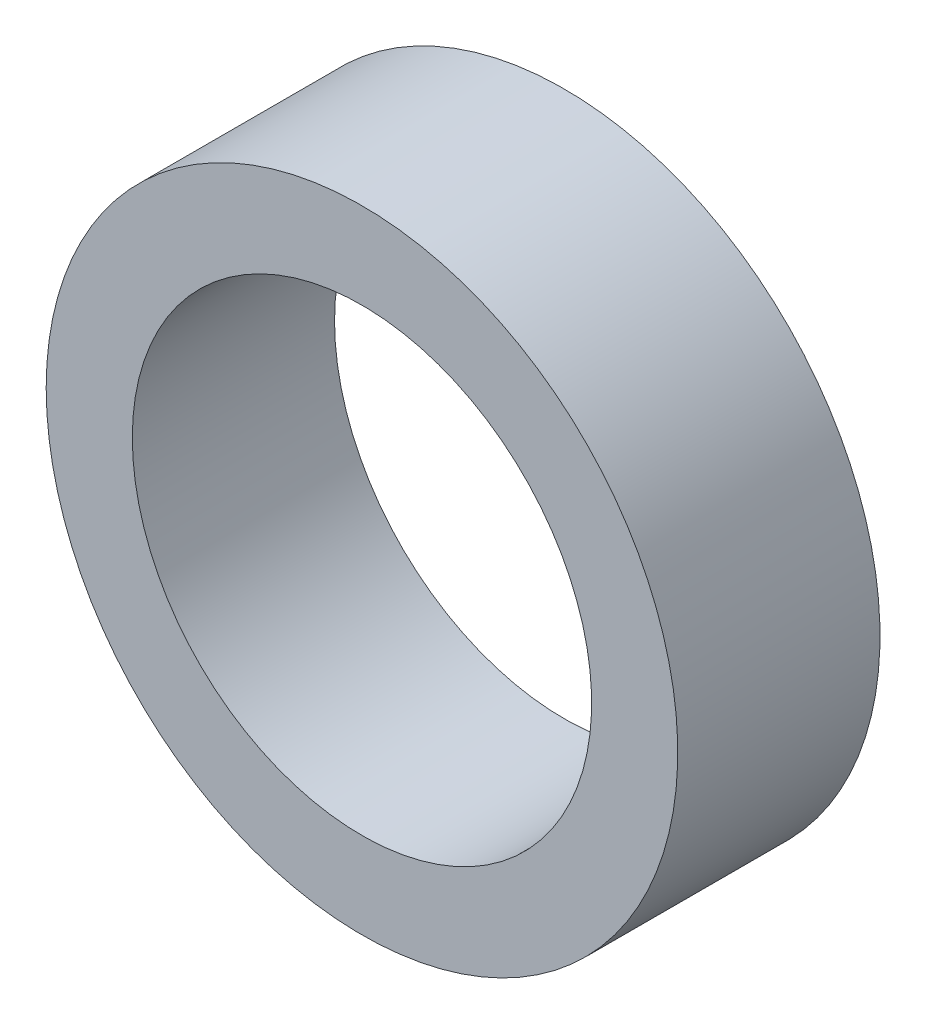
from build123d import *

# Parameters (mm, degrees)
SKETCH1_R           = 10.3124
SKETCH1_R_2         = 7.5
BOSS_EXTRUDE1_DEPTH = 6.604


with BuildPart() as part:
    # Sketch1 → Boss-Extrude1 (new body)
    with BuildSketch(Plane.XY):
        with Locations(Location((0, 0, 0), (0, 0, 180))):
            Circle(SKETCH1_R)
        with Locations(Location((0, 0, 0), (0, 0, 180))):
            Circle(SKETCH1_R_2, mode=Mode.SUBTRACT)
    extrude(amount=BOSS_EXTRUDE1_DEPTH)


solid = part.part
